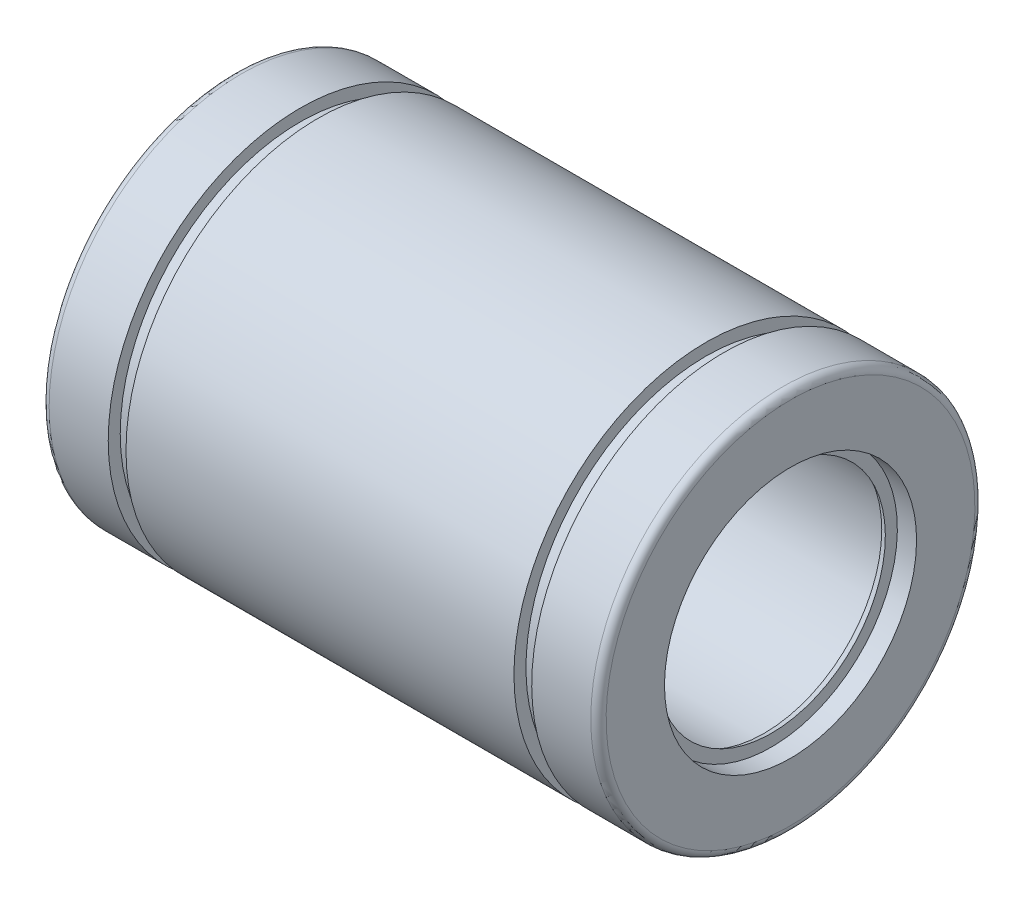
ISO-10303-21;
HEADER;
FILE_DESCRIPTION(('STEP AP214'),'2;1');
FILE_NAME('part.step','',(''),(''),'','','');
FILE_SCHEMA(('AUTOMOTIVE_DESIGN { 1 0 10303 214 1 1 1 1 }'));
ENDSEC;
DATA;
#1=APPLICATION_CONTEXT('core data for automotive mechanical design processes');
#2=APPLICATION_PROTOCOL_DEFINITION('international standard','automotive_design',2000,#1);
#3=PRODUCT_CONTEXT('',#1,'mechanical');
#4=PRODUCT('Part','Part','',(#3));
#5=PRODUCT_RELATED_PRODUCT_CATEGORY('part','',(#4));
#6=PRODUCT_DEFINITION_FORMATION('','',#4);
#7=PRODUCT_DEFINITION_CONTEXT('part definition',#1,'design');
#8=PRODUCT_DEFINITION('design','',#6,#7);
#9=PRODUCT_DEFINITION_SHAPE('','',#8);
#10=(LENGTH_UNIT() NAMED_UNIT(*) SI_UNIT(.MILLI.,.METRE.));
#11=(NAMED_UNIT(*) PLANE_ANGLE_UNIT() SI_UNIT($,.RADIAN.));
#12=(NAMED_UNIT(*) SI_UNIT($,.STERADIAN.) SOLID_ANGLE_UNIT());
#13=UNCERTAINTY_MEASURE_WITH_UNIT(LENGTH_MEASURE(1.E-05),#10,'distance_accuracy_value','');
#14=(GEOMETRIC_REPRESENTATION_CONTEXT(3) GLOBAL_UNCERTAINTY_ASSIGNED_CONTEXT((#13)) GLOBAL_UNIT_ASSIGNED_CONTEXT((#10,
#11,#12)) REPRESENTATION_CONTEXT('',''));
#15=CARTESIAN_POINT('',(0.,0.,0.));
#16=DIRECTION('',(0.,0.,1.));
#17=DIRECTION('',(1.,0.,0.));
#18=AXIS2_PLACEMENT_3D('',#15,#16,#17);
#19=CARTESIAN_POINT('',(0.,0.,-10.));
#20=DIRECTION('',(-1.,0.,0.));
#21=DIRECTION('',(0.,0.,1.));
#22=AXIS2_PLACEMENT_3D('',#19,#20,#21);
#23=PLANE('',#22);
#24=CARTESIAN_POINT('',(0.,0.,0.));
#25=DIRECTION('',(1.,0.,0.));
#26=DIRECTION('',(0.,0.,-1.));
#27=AXIS2_PLACEMENT_3D('',#24,#25,#26);
#28=CIRCLE('',#27,13.125);
#29=CARTESIAN_POINT('',(0.,0.,13.125));
#30=VERTEX_POINT('',#29);
#31=EDGE_CURVE('E233',#30,#30,#28,.T.);
#32=ORIENTED_EDGE('',*,*,#31,.T.);
#33=EDGE_LOOP('',(#32));
#34=FACE_BOUND('',#33,.T.);
#35=CARTESIAN_POINT('',(0.,0.,0.));
#36=DIRECTION('',(-1.,0.,0.));
#37=DIRECTION('',(0.,0.,1.));
#38=AXIS2_PLACEMENT_3D('',#35,#36,#37);
#39=CIRCLE('',#38,19.2);
#40=CARTESIAN_POINT('',(0.,0.,19.2));
#41=VERTEX_POINT('',#40);
#42=CARTESIAN_POINT('',(0.,19.2,0.));
#43=VERTEX_POINT('',#42);
#44=EDGE_CURVE('E350',#41,#43,#39,.T.);
#45=ORIENTED_EDGE('',*,*,#44,.T.);
#46=CARTESIAN_POINT('',(0.,0.,0.));
#47=DIRECTION('',(-1.,0.,0.));
#48=DIRECTION('',(0.,0.,1.));
#49=AXIS2_PLACEMENT_3D('',#46,#47,#48);
#50=CIRCLE('',#49,19.2);
#51=EDGE_CURVE('E354',#43,#41,#50,.T.);
#52=ORIENTED_EDGE('',*,*,#51,.T.);
#53=EDGE_LOOP('',(#45,#52));
#54=FACE_BOUND('',#53,.T.);
#55=ADVANCED_FACE('F16',(#34,#54),#23,.T.);
#56=CARTESIAN_POINT('',(8.8,0.,-19.375));
#57=DIRECTION('',(1.,0.,0.));
#58=DIRECTION('',(0.,1.,0.));
#59=AXIS2_PLACEMENT_3D('',#56,#57,#58);
#60=PLANE('',#59);
#61=CARTESIAN_POINT('',(8.8,0.,0.));
#62=DIRECTION('',(1.,0.,0.));
#63=DIRECTION('',(0.,0.,-1.));
#64=AXIS2_PLACEMENT_3D('',#61,#62,#63);
#65=CIRCLE('',#64,18.75);
#66=CARTESIAN_POINT('',(8.8,0.,18.75));
#67=VERTEX_POINT('',#66);
#68=EDGE_CURVE('E222',#67,#67,#65,.T.);
#69=ORIENTED_EDGE('',*,*,#68,.T.);
#70=EDGE_LOOP('',(#69));
#71=FACE_BOUND('',#70,.T.);
#72=CARTESIAN_POINT('',(8.8,0.,0.));
#73=DIRECTION('',(1.,0.,0.));
#74=DIRECTION('',(0.,0.,-1.));
#75=AXIS2_PLACEMENT_3D('',#72,#73,#74);
#76=CIRCLE('',#75,20.);
#77=CARTESIAN_POINT('',(8.8,0.,20.));
#78=VERTEX_POINT('',#77);
#79=EDGE_CURVE('E204',#78,#78,#76,.T.);
#80=ORIENTED_EDGE('',*,*,#79,.F.);
#81=EDGE_LOOP('',(#80));
#82=FACE_BOUND('',#81,.T.);
#83=ADVANCED_FACE('F401',(#71,#82),#60,.F.);
#84=CARTESIAN_POINT('',(6.95,0.,-19.375));
#85=DIRECTION('',(-1.,0.,0.));
#86=DIRECTION('',(0.,0.,1.));
#87=AXIS2_PLACEMENT_3D('',#84,#85,#86);
#88=PLANE('',#87);
#89=CARTESIAN_POINT('',(6.95,0.,0.));
#90=DIRECTION('',(1.,0.,0.));
#91=DIRECTION('',(0.,0.,-1.));
#92=AXIS2_PLACEMENT_3D('',#89,#90,#91);
#93=CIRCLE('',#92,18.75);
#94=CARTESIAN_POINT('',(6.95,0.,18.75));
#95=VERTEX_POINT('',#94);
#96=EDGE_CURVE('E198',#95,#95,#93,.T.);
#97=ORIENTED_EDGE('',*,*,#96,.F.);
#98=EDGE_LOOP('',(#97));
#99=FACE_BOUND('',#98,.T.);
#100=CARTESIAN_POINT('',(6.95,0.,0.));
#101=DIRECTION('',(-1.,0.,0.));
#102=DIRECTION('',(0.,0.,-1.));
#103=AXIS2_PLACEMENT_3D('',#100,#101,#102);
#104=CIRCLE('',#103,20.);
#105=CARTESIAN_POINT('',(6.95,0.,20.));
#106=VERTEX_POINT('',#105);
#107=EDGE_CURVE('E432',#106,#106,#104,.T.);
#108=ORIENTED_EDGE('',*,*,#107,.F.);
#109=EDGE_LOOP('',(#108));
#110=FACE_BOUND('',#109,.T.);
#111=ADVANCED_FACE('F406',(#99,#110),#88,.F.);
#112=CARTESIAN_POINT('',(2.,0.,-13.75));
#113=DIRECTION('',(-1.,0.,0.));
#114=DIRECTION('',(0.,0.,1.));
#115=AXIS2_PLACEMENT_3D('',#112,#113,#114);
#116=PLANE('',#115);
#117=CARTESIAN_POINT('',(2.,0.,0.));
#118=DIRECTION('',(1.,0.,0.));
#119=DIRECTION('',(0.,0.,-1.));
#120=AXIS2_PLACEMENT_3D('',#117,#118,#119);
#121=CIRCLE('',#120,13.125);
#122=CARTESIAN_POINT('',(2.,0.,13.125));
#123=VERTEX_POINT('',#122);
#124=EDGE_CURVE('E225',#123,#123,#121,.T.);
#125=ORIENTED_EDGE('',*,*,#124,.F.);
#126=EDGE_LOOP('',(#125));
#127=FACE_BOUND('',#126,.T.);
#128=CARTESIAN_POINT('',(2.,0.,0.));
#129=DIRECTION('',(1.,0.,0.));
#130=DIRECTION('',(0.,0.,-1.));
#131=AXIS2_PLACEMENT_3D('',#128,#129,#130);
#132=CIRCLE('',#131,15.);
#133=CARTESIAN_POINT('',(2.,0.,15.));
#134=VERTEX_POINT('',#133);
#135=EDGE_CURVE('E250',#134,#134,#132,.T.);
#136=ORIENTED_EDGE('',*,*,#135,.T.);
#137=EDGE_LOOP('',(#136));
#138=FACE_BOUND('',#137,.T.);
#139=ADVANCED_FACE('F456',(#127,#138),#116,.F.);
#140=CARTESIAN_POINT('',(2.75,0.,-13.75));
#141=DIRECTION('',(1.,0.,0.));
#142=DIRECTION('',(0.,0.,-1.));
#143=AXIS2_PLACEMENT_3D('',#140,#141,#142);
#144=PLANE('',#143);
#145=CARTESIAN_POINT('',(2.75,0.,0.));
#146=DIRECTION('',(-1.,0.,0.));
#147=DIRECTION('',(0.,0.,-1.));
#148=AXIS2_PLACEMENT_3D('',#145,#146,#147);
#149=CIRCLE('',#148,12.5);
#150=CARTESIAN_POINT('',(2.75,0.,12.5));
#151=VERTEX_POINT('',#150);
#152=EDGE_CURVE('E365',#151,#151,#149,.T.);
#153=ORIENTED_EDGE('',*,*,#152,.F.);
#154=EDGE_LOOP('',(#153));
#155=FACE_BOUND('',#154,.T.);
#156=CARTESIAN_POINT('',(2.75,0.,0.));
#157=DIRECTION('',(1.,0.,0.));
#158=DIRECTION('',(0.,0.,-1.));
#159=AXIS2_PLACEMENT_3D('',#156,#157,#158);
#160=CIRCLE('',#159,15.);
#161=CARTESIAN_POINT('',(2.75,0.,15.));
#162=VERTEX_POINT('',#161);
#163=EDGE_CURVE('E314',#162,#162,#160,.T.);
#164=ORIENTED_EDGE('',*,*,#163,.F.);
#165=EDGE_LOOP('',(#164));
#166=FACE_BOUND('',#165,.T.);
#167=ADVANCED_FACE('F458',(#155,#166),#144,.F.);
#168=CARTESIAN_POINT('',(58.,5.,8.66025403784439));
#169=DIRECTION('',(1.,0.,0.));
#170=DIRECTION('',(0.,-1.,0.));
#171=AXIS2_PLACEMENT_3D('',#168,#169,#170);
#172=PLANE('',#171);
#173=CARTESIAN_POINT('',(58.,0.,0.));
#174=DIRECTION('',(-1.,0.,0.));
#175=DIRECTION('',(0.,0.5,0.866025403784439));
#176=AXIS2_PLACEMENT_3D('',#173,#174,#175);
#177=CIRCLE('',#176,13.125);
#178=CARTESIAN_POINT('',(58.,-6.5625,-11.3665834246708));
#179=VERTEX_POINT('',#178);
#180=EDGE_CURVE('E300',#179,#179,#177,.T.);
#181=ORIENTED_EDGE('',*,*,#180,.T.);
#182=EDGE_LOOP('',(#181));
#183=FACE_BOUND('',#182,.T.);
#184=CARTESIAN_POINT('',(58.,0.,0.));
#185=DIRECTION('',(1.,0.,0.));
#186=DIRECTION('',(0.,0.,-1.));
#187=AXIS2_PLACEMENT_3D('',#184,#185,#186);
#188=CIRCLE('',#187,19.2);
#189=CARTESIAN_POINT('',(58.,-9.6,-16.6276877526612));
#190=VERTEX_POINT('',#189);
#191=CARTESIAN_POINT('',(58.,16.6276877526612,-9.6));
#192=VERTEX_POINT('',#191);
#193=EDGE_CURVE('E271',#190,#192,#188,.T.);
#194=ORIENTED_EDGE('',*,*,#193,.T.);
#195=CARTESIAN_POINT('',(58.,0.,0.));
#196=DIRECTION('',(1.,0.,0.));
#197=DIRECTION('',(0.,0.,-1.));
#198=AXIS2_PLACEMENT_3D('',#195,#196,#197);
#199=CIRCLE('',#198,19.2);
#200=EDGE_CURVE('E276',#192,#190,#199,.T.);
#201=ORIENTED_EDGE('',*,*,#200,.T.);
#202=EDGE_LOOP('',(#194,#201));
#203=FACE_BOUND('',#202,.T.);
#204=ADVANCED_FACE('F465',(#183,#203),#172,.T.);
#205=CARTESIAN_POINT('',(49.2,9.6875,16.7792421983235));
#206=DIRECTION('',(-1.,0.,0.));
#207=DIRECTION('',(0.,0.,1.));
#208=AXIS2_PLACEMENT_3D('',#205,#206,#207);
#209=PLANE('',#208);
#210=CARTESIAN_POINT('',(49.2,0.,0.));
#211=DIRECTION('',(-1.,0.,0.));
#212=DIRECTION('',(0.,0.5,0.866025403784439));
#213=AXIS2_PLACEMENT_3D('',#210,#211,#212);
#214=CIRCLE('',#213,18.75);
#215=CARTESIAN_POINT('',(49.2,-9.375,-16.2379763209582));
#216=VERTEX_POINT('',#215);
#217=EDGE_CURVE('E289',#216,#216,#214,.T.);
#218=ORIENTED_EDGE('',*,*,#217,.T.);
#219=EDGE_LOOP('',(#218));
#220=FACE_BOUND('',#219,.T.);
#221=CARTESIAN_POINT('',(49.2,0.,0.));
#222=DIRECTION('',(-1.,0.,0.));
#223=DIRECTION('',(0.,0.5,0.866025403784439));
#224=AXIS2_PLACEMENT_3D('',#221,#222,#223);
#225=CIRCLE('',#224,20.);
#226=CARTESIAN_POINT('',(49.2,10.,17.3205080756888));
#227=VERTEX_POINT('',#226);
#228=CARTESIAN_POINT('',(49.2,0.,20.));
#229=VERTEX_POINT('',#228);
#230=EDGE_CURVE('E189',#227,#229,#225,.T.);
#231=ORIENTED_EDGE('',*,*,#230,.F.);
#232=CARTESIAN_POINT('',(49.2,0.,0.));
#233=DIRECTION('',(-1.,0.,0.));
#234=DIRECTION('',(0.,0.5,0.866025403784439));
#235=AXIS2_PLACEMENT_3D('',#232,#233,#234);
#236=CIRCLE('',#235,20.);
#237=EDGE_CURVE('E195',#229,#227,#236,.T.);
#238=ORIENTED_EDGE('',*,*,#237,.F.);
#239=EDGE_LOOP('',(#231,#238));
#240=FACE_BOUND('',#239,.T.);
#241=ADVANCED_FACE('F200',(#220,#240),#209,.F.);
#242=CARTESIAN_POINT('',(51.05,9.6875,16.7792421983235));
#243=DIRECTION('',(1.,0.,0.));
#244=DIRECTION('',(0.,-1.,0.));
#245=AXIS2_PLACEMENT_3D('',#242,#243,#244);
#246=PLANE('',#245);
#247=CARTESIAN_POINT('',(51.05,0.,0.));
#248=DIRECTION('',(-1.,0.,0.));
#249=DIRECTION('',(0.,0.5,0.866025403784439));
#250=AXIS2_PLACEMENT_3D('',#247,#248,#249);
#251=CIRCLE('',#250,18.75);
#252=CARTESIAN_POINT('',(51.05,-9.375,-16.2379763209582));
#253=VERTEX_POINT('',#252);
#254=EDGE_CURVE('E275',#253,#253,#251,.T.);
#255=ORIENTED_EDGE('',*,*,#254,.F.);
#256=EDGE_LOOP('',(#255));
#257=FACE_BOUND('',#256,.T.);
#258=CARTESIAN_POINT('',(51.05,0.,0.));
#259=DIRECTION('',(1.,0.,0.));
#260=DIRECTION('',(0.,0.5,0.866025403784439));
#261=AXIS2_PLACEMENT_3D('',#258,#259,#260);
#262=CIRCLE('',#261,20.);
#263=CARTESIAN_POINT('',(51.05,-10.,-17.3205080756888));
#264=VERTEX_POINT('',#263);
#265=EDGE_CURVE('E265',#264,#264,#262,.T.);
#266=ORIENTED_EDGE('',*,*,#265,.F.);
#267=EDGE_LOOP('',(#266));
#268=FACE_BOUND('',#267,.T.);
#269=ADVANCED_FACE('F474',(#257,#268),#246,.F.);
#270=CARTESIAN_POINT('',(56.,6.875,11.907849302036));
#271=DIRECTION('',(1.,0.,0.));
#272=DIRECTION('',(0.,-1.,0.));
#273=AXIS2_PLACEMENT_3D('',#270,#271,#272);
#274=PLANE('',#273);
#275=CARTESIAN_POINT('',(56.,0.,0.));
#276=DIRECTION('',(-1.,0.,0.));
#277=DIRECTION('',(0.,0.5,0.866025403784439));
#278=AXIS2_PLACEMENT_3D('',#275,#276,#277);
#279=CIRCLE('',#278,13.125);
#280=CARTESIAN_POINT('',(56.,-6.5625,-11.3665834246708));
#281=VERTEX_POINT('',#280);
#282=EDGE_CURVE('E292',#281,#281,#279,.T.);
#283=ORIENTED_EDGE('',*,*,#282,.F.);
#284=EDGE_LOOP('',(#283));
#285=FACE_BOUND('',#284,.T.);
#286=CARTESIAN_POINT('',(56.,0.,0.));
#287=DIRECTION('',(-1.,0.,0.));
#288=DIRECTION('',(0.,0.5,0.866025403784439));
#289=AXIS2_PLACEMENT_3D('',#286,#287,#288);
#290=CIRCLE('',#289,15.);
#291=CARTESIAN_POINT('',(56.,-7.5,-12.9903810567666));
#292=VERTEX_POINT('',#291);
#293=EDGE_CURVE('E311',#292,#292,#290,.T.);
#294=ORIENTED_EDGE('',*,*,#293,.T.);
#295=EDGE_LOOP('',(#294));
#296=FACE_BOUND('',#295,.T.);
#297=ADVANCED_FACE('F380',(#285,#296),#274,.F.);
#298=CARTESIAN_POINT('',(55.25,6.875,11.907849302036));
#299=DIRECTION('',(-1.,0.,0.));
#300=DIRECTION('',(0.,0.,1.));
#301=AXIS2_PLACEMENT_3D('',#298,#299,#300);
#302=PLANE('',#301);
#303=CARTESIAN_POINT('',(55.25,0.,0.));
#304=DIRECTION('',(1.,0.,0.));
#305=DIRECTION('',(0.,0.5,0.866025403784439));
#306=AXIS2_PLACEMENT_3D('',#303,#304,#305);
#307=CIRCLE('',#306,12.5);
#308=CARTESIAN_POINT('',(55.25,6.25,10.8253175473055));
#309=VERTEX_POINT('',#308);
#310=CARTESIAN_POINT('',(55.25,0.,12.5));
#311=VERTEX_POINT('',#310);
#312=EDGE_CURVE('E359',#309,#311,#307,.T.);
#313=ORIENTED_EDGE('',*,*,#312,.F.);
#314=CARTESIAN_POINT('',(55.25,0.,0.));
#315=DIRECTION('',(1.,0.,0.));
#316=DIRECTION('',(0.,0.5,0.866025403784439));
#317=AXIS2_PLACEMENT_3D('',#314,#315,#316);
#318=CIRCLE('',#317,12.5);
#319=EDGE_CURVE('E211',#311,#309,#318,.T.);
#320=ORIENTED_EDGE('',*,*,#319,.F.);
#321=EDGE_LOOP('',(#313,#320));
#322=FACE_BOUND('',#321,.T.);
#323=CARTESIAN_POINT('',(55.25,0.,0.));
#324=DIRECTION('',(-1.,0.,0.));
#325=DIRECTION('',(0.,0.5,0.866025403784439));
#326=AXIS2_PLACEMENT_3D('',#323,#324,#325);
#327=CIRCLE('',#326,15.);
#328=CARTESIAN_POINT('',(55.25,-7.5,-12.9903810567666));
#329=VERTEX_POINT('',#328);
#330=EDGE_CURVE('E320',#329,#329,#327,.T.);
#331=ORIENTED_EDGE('',*,*,#330,.F.);
#332=EDGE_LOOP('',(#331));
#333=FACE_BOUND('',#332,.T.);
#334=ADVANCED_FACE('F376',(#322,#333),#302,.F.);
#335=CARTESIAN_POINT('',(2.749,0.,-7.5075));
#336=DIRECTION('',(1.,0.,0.));
#337=DIRECTION('',(0.,1.,0.));
#338=AXIS2_PLACEMENT_3D('',#335,#336,#337);
#339=PLANE('',#338);
#340=CARTESIAN_POINT('',(2.749,0.,0.));
#341=DIRECTION('',(-1.,0.,0.));
#342=DIRECTION('',(0.,0.,-1.));
#343=AXIS2_PLACEMENT_3D('',#340,#341,#342);
#344=CIRCLE('',#343,12.25);
#345=CARTESIAN_POINT('',(2.749,0.,12.25));
#346=VERTEX_POINT('',#345);
#347=EDGE_CURVE('E332',#346,#346,#344,.T.);
#348=ORIENTED_EDGE('',*,*,#347,.T.);
#349=EDGE_LOOP('',(#348));
#350=FACE_BOUND('',#349,.T.);
#351=CARTESIAN_POINT('',(2.749,0.,0.));
#352=DIRECTION('',(-1.,0.,0.));
#353=DIRECTION('',(0.,0.,-1.));
#354=AXIS2_PLACEMENT_3D('',#351,#352,#353);
#355=CIRCLE('',#354,15.);
#356=CARTESIAN_POINT('',(2.749,0.,15.));
#357=VERTEX_POINT('',#356);
#358=EDGE_CURVE('E258',#357,#357,#355,.T.);
#359=ORIENTED_EDGE('',*,*,#358,.F.);
#360=EDGE_LOOP('',(#359));
#361=FACE_BOUND('',#360,.T.);
#362=ADVANCED_FACE('F379',(#350,#361),#339,.T.);
#363=CARTESIAN_POINT('',(2.001,0.,-7.5075));
#364=DIRECTION('',(-1.,0.,0.));
#365=DIRECTION('',(0.,0.,1.));
#366=AXIS2_PLACEMENT_3D('',#363,#364,#365);
#367=PLANE('',#366);
#368=CARTESIAN_POINT('',(2.001,0.,0.));
#369=DIRECTION('',(1.,0.,0.));
#370=DIRECTION('',(0.,0.,-1.));
#371=AXIS2_PLACEMENT_3D('',#368,#369,#370);
#372=CIRCLE('',#371,11.875);
#373=CARTESIAN_POINT('',(2.001,0.,11.875));
#374=VERTEX_POINT('',#373);
#375=EDGE_CURVE('E253',#374,#374,#372,.T.);
#376=ORIENTED_EDGE('',*,*,#375,.T.);
#377=EDGE_LOOP('',(#376));
#378=FACE_BOUND('',#377,.T.);
#379=CARTESIAN_POINT('',(2.001,0.,0.));
#380=DIRECTION('',(1.,0.,0.));
#381=DIRECTION('',(0.,0.,-1.));
#382=AXIS2_PLACEMENT_3D('',#379,#380,#381);
#383=CIRCLE('',#382,15.);
#384=CARTESIAN_POINT('',(2.001,0.,15.));
#385=VERTEX_POINT('',#384);
#386=EDGE_CURVE('E236',#385,#385,#383,.T.);
#387=ORIENTED_EDGE('',*,*,#386,.F.);
#388=EDGE_LOOP('',(#387));
#389=FACE_BOUND('',#388,.T.);
#390=ADVANCED_FACE('F446',(#378,#389),#367,.T.);
#391=CARTESIAN_POINT('',(55.251,3.75375,6.50168571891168));
#392=DIRECTION('',(-1.,0.,0.));
#393=DIRECTION('',(0.,0.,1.));
#394=AXIS2_PLACEMENT_3D('',#391,#392,#393);
#395=PLANE('',#394);
#396=CARTESIAN_POINT('',(55.251,0.,0.));
#397=DIRECTION('',(1.,0.,0.));
#398=DIRECTION('',(0.,0.5,0.866025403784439));
#399=AXIS2_PLACEMENT_3D('',#396,#397,#398);
#400=CIRCLE('',#399,12.25);
#401=CARTESIAN_POINT('',(55.251,-6.125,-10.6088111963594));
#402=VERTEX_POINT('',#401);
#403=EDGE_CURVE('E10',#402,#402,#400,.T.);
#404=ORIENTED_EDGE('',*,*,#403,.T.);
#405=EDGE_LOOP('',(#404));
#406=FACE_BOUND('',#405,.T.);
#407=CARTESIAN_POINT('',(55.251,0.,0.));
#408=DIRECTION('',(1.,0.,0.));
#409=DIRECTION('',(0.,0.5,0.866025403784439));
#410=AXIS2_PLACEMENT_3D('',#407,#408,#409);
#411=CIRCLE('',#410,15.);
#412=CARTESIAN_POINT('',(55.251,-7.5,-12.9903810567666));
#413=VERTEX_POINT('',#412);
#414=EDGE_CURVE('E319',#413,#413,#411,.T.);
#415=ORIENTED_EDGE('',*,*,#414,.F.);
#416=EDGE_LOOP('',(#415));
#417=FACE_BOUND('',#416,.T.);
#418=ADVANCED_FACE('F449',(#406,#417),#395,.T.);
#419=CARTESIAN_POINT('',(55.999,3.75375,6.50168571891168));
#420=DIRECTION('',(1.,0.,0.));
#421=DIRECTION('',(0.,-1.,0.));
#422=AXIS2_PLACEMENT_3D('',#419,#420,#421);
#423=PLANE('',#422);
#424=CARTESIAN_POINT('',(55.999,0.,0.));
#425=DIRECTION('',(-1.,0.,0.));
#426=DIRECTION('',(0.,0.5,0.866025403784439));
#427=AXIS2_PLACEMENT_3D('',#424,#425,#426);
#428=CIRCLE('',#427,11.875);
#429=CARTESIAN_POINT('',(55.999,-5.9375,-10.2840516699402));
#430=VERTEX_POINT('',#429);
#431=EDGE_CURVE('E19',#430,#430,#428,.T.);
#432=ORIENTED_EDGE('',*,*,#431,.T.);
#433=EDGE_LOOP('',(#432));
#434=FACE_BOUND('',#433,.T.);
#435=CARTESIAN_POINT('',(55.999,0.,0.));
#436=DIRECTION('',(-1.,0.,0.));
#437=DIRECTION('',(0.,0.5,0.866025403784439));
#438=AXIS2_PLACEMENT_3D('',#435,#436,#437);
#439=CIRCLE('',#438,15.);
#440=CARTESIAN_POINT('',(55.999,-7.5,-12.9903810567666));
#441=VERTEX_POINT('',#440);
#442=EDGE_CURVE('E303',#441,#441,#439,.T.);
#443=ORIENTED_EDGE('',*,*,#442,.F.);
#444=EDGE_LOOP('',(#443));
#445=FACE_BOUND('',#444,.T.);
#446=ADVANCED_FACE('F396',(#434,#445),#423,.T.);
#447=CARTESIAN_POINT('',(55.625,0.,0.));
#448=DIRECTION('',(-1.,0.,0.));
#449=DIRECTION('',(0.,0.5,0.866025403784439));
#450=AXIS2_PLACEMENT_3D('',#447,#448,#449);
#451=CONICAL_SURFACE('',#450,12.0625,0.464716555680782);
#452=ORIENTED_EDGE('',*,*,#431,.F.);
#453=DIRECTION('',(-0.893948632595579,-0.224084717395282,-0.388126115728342));
#454=VECTOR('',#453,1.);
#455=CARTESIAN_POINT('',(55.625,-6.03125,-10.4464314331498));
#456=LINE('',#455,#454);
#457=EDGE_CURVE('E25',#430,#402,#456,.T.);
#458=ORIENTED_EDGE('',*,*,#457,.T.);
#459=ORIENTED_EDGE('',*,*,#403,.F.);
#460=ORIENTED_EDGE('',*,*,#457,.F.);
#461=EDGE_LOOP('',(#452,#458,#459,#460));
#462=FACE_BOUND('',#461,.T.);
#463=ADVANCED_FACE('F386',(#462),#451,.F.);
#464=CARTESIAN_POINT('',(55.625,0.,0.));
#465=DIRECTION('',(1.,0.,0.));
#466=DIRECTION('',(0.,0.5,0.866025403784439));
#467=AXIS2_PLACEMENT_3D('',#464,#465,#466);
#468=CYLINDRICAL_SURFACE('',#467,15.);
#469=ORIENTED_EDGE('',*,*,#330,.T.);
#470=DIRECTION('',(1.,0.,0.));
#471=VECTOR('',#470,1.);
#472=CARTESIAN_POINT('',(55.625,-7.5,-12.9903810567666));
#473=LINE('',#472,#471);
#474=EDGE_CURVE('E315',#329,#413,#473,.T.);
#475=ORIENTED_EDGE('',*,*,#474,.T.);
#476=ORIENTED_EDGE('',*,*,#414,.T.);
#477=ORIENTED_EDGE('',*,*,#474,.F.);
#478=EDGE_LOOP('',(#469,#475,#476,#477));
#479=FACE_BOUND('',#478,.T.);
#480=ADVANCED_FACE('F383',(#479),#468,.F.);
#481=CARTESIAN_POINT('',(2.375,0.,0.));
#482=DIRECTION('',(1.,0.,0.));
#483=DIRECTION('',(0.,0.,-1.));
#484=AXIS2_PLACEMENT_3D('',#481,#482,#483);
#485=CONICAL_SURFACE('',#484,12.0625,0.464716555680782);
#486=ORIENTED_EDGE('',*,*,#375,.F.);
#487=DIRECTION('',(0.893948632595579,0.,0.448169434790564));
#488=VECTOR('',#487,1.);
#489=CARTESIAN_POINT('',(2.375,0.,12.0625));
#490=LINE('',#489,#488);
#491=EDGE_CURVE('E257',#374,#346,#490,.T.);
#492=ORIENTED_EDGE('',*,*,#491,.T.);
#493=ORIENTED_EDGE('',*,*,#347,.F.);
#494=ORIENTED_EDGE('',*,*,#491,.F.);
#495=EDGE_LOOP('',(#486,#492,#493,#494));
#496=FACE_BOUND('',#495,.T.);
#497=ADVANCED_FACE('F385',(#496),#485,.F.);
#498=CARTESIAN_POINT('',(2.375,0.,0.));
#499=DIRECTION('',(-1.,0.,0.));
#500=DIRECTION('',(0.,0.,-1.));
#501=AXIS2_PLACEMENT_3D('',#498,#499,#500);
#502=CYLINDRICAL_SURFACE('',#501,15.);
#503=ORIENTED_EDGE('',*,*,#163,.T.);
#504=DIRECTION('',(-1.,0.,0.));
#505=VECTOR('',#504,1.);
#506=CARTESIAN_POINT('',(2.375,0.,15.));
#507=LINE('',#506,#505);
#508=EDGE_CURVE('E324',#162,#357,#507,.T.);
#509=ORIENTED_EDGE('',*,*,#508,.T.);
#510=ORIENTED_EDGE('',*,*,#358,.T.);
#511=ORIENTED_EDGE('',*,*,#508,.F.);
#512=EDGE_LOOP('',(#503,#509,#510,#511));
#513=FACE_BOUND('',#512,.T.);
#514=ADVANCED_FACE('F393',(#513),#502,.F.);
#515=CARTESIAN_POINT('',(55.625,0.,0.));
#516=DIRECTION('',(1.,0.,0.));
#517=DIRECTION('',(0.,0.5,0.866025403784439));
#518=AXIS2_PLACEMENT_3D('',#515,#516,#517);
#519=CYLINDRICAL_SURFACE('',#518,15.);
#520=ORIENTED_EDGE('',*,*,#442,.T.);
#521=DIRECTION('',(1.,0.,0.));
#522=VECTOR('',#521,1.);
#523=CARTESIAN_POINT('',(55.625,-7.5,-12.9903810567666));
#524=LINE('',#523,#522);
#525=EDGE_CURVE('E307',#441,#292,#524,.T.);
#526=ORIENTED_EDGE('',*,*,#525,.T.);
#527=ORIENTED_EDGE('',*,*,#293,.F.);
#528=ORIENTED_EDGE('',*,*,#525,.F.);
#529=EDGE_LOOP('',(#520,#526,#527,#528));
#530=FACE_BOUND('',#529,.T.);
#531=ADVANCED_FACE('F492',(#530),#519,.F.);
#532=CARTESIAN_POINT('',(57.,0.,0.));
#533=DIRECTION('',(1.,0.,0.));
#534=DIRECTION('',(0.,0.5,0.866025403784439));
#535=AXIS2_PLACEMENT_3D('',#532,#533,#534);
#536=CYLINDRICAL_SURFACE('',#535,13.125);
#537=ORIENTED_EDGE('',*,*,#282,.T.);
#538=DIRECTION('',(1.,0.,0.));
#539=VECTOR('',#538,1.);
#540=CARTESIAN_POINT('',(57.,-6.5625,-11.3665834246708));
#541=LINE('',#540,#539);
#542=EDGE_CURVE('E296',#281,#179,#541,.T.);
#543=ORIENTED_EDGE('',*,*,#542,.T.);
#544=ORIENTED_EDGE('',*,*,#180,.F.);
#545=ORIENTED_EDGE('',*,*,#542,.F.);
#546=EDGE_LOOP('',(#537,#543,#544,#545));
#547=FACE_BOUND('',#546,.T.);
#548=ADVANCED_FACE('F496',(#547),#536,.F.);
#549=CARTESIAN_POINT('',(50.5875,0.,0.));
#550=DIRECTION('',(1.,0.,0.));
#551=DIRECTION('',(0.,0.5,0.866025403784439));
#552=AXIS2_PLACEMENT_3D('',#549,#550,#551);
#553=CYLINDRICAL_SURFACE('',#552,18.75);
#554=ORIENTED_EDGE('',*,*,#254,.T.);
#555=DIRECTION('',(-1.,0.,0.));
#556=VECTOR('',#555,1.);
#557=CARTESIAN_POINT('',(50.5875,-9.375,-16.2379763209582));
#558=LINE('',#557,#556);
#559=EDGE_CURVE('E285',#253,#216,#558,.T.);
#560=ORIENTED_EDGE('',*,*,#559,.T.);
#561=ORIENTED_EDGE('',*,*,#217,.F.);
#562=ORIENTED_EDGE('',*,*,#559,.F.);
#563=EDGE_LOOP('',(#554,#560,#561,#562));
#564=FACE_BOUND('',#563,.T.);
#565=ADVANCED_FACE('F502',(#564),#553,.T.);
#566=CARTESIAN_POINT('',(57.2,0.,0.));
#567=DIRECTION('',(1.,0.,0.));
#568=DIRECTION('',(0.,-0.866025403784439,0.5));
#569=AXIS2_PLACEMENT_3D('',#566,#567,#568);
#570=TOROIDAL_SURFACE('',#569,19.2,0.8);
#571=ORIENTED_EDGE('',*,*,#193,.F.);
#572=ORIENTED_EDGE('',*,*,#200,.F.);
#573=CARTESIAN_POINT('',(57.2,16.6276877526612,-9.6));
#574=DIRECTION('',(0.,0.5,0.866025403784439));
#575=DIRECTION('',(0.,0.866025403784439,-0.5));
#576=AXIS2_PLACEMENT_3D('',#573,#574,#575);
#577=CIRCLE('',#576,0.8);
#578=CARTESIAN_POINT('',(57.2,17.3205080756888,-10.));
#579=VERTEX_POINT('',#578);
#580=EDGE_CURVE('E272',#192,#579,#577,.T.);
#581=ORIENTED_EDGE('',*,*,#580,.T.);
#582=CARTESIAN_POINT('',(57.2,0.,0.));
#583=DIRECTION('',(-1.,0.,0.));
#584=DIRECTION('',(0.,0.5,0.866025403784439));
#585=AXIS2_PLACEMENT_3D('',#582,#583,#584);
#586=CIRCLE('',#585,20.);
#587=CARTESIAN_POINT('',(57.2,-17.3205080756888,10.));
#588=VERTEX_POINT('',#587);
#589=EDGE_CURVE('E246',#588,#579,#586,.T.);
#590=ORIENTED_EDGE('',*,*,#589,.F.);
#591=CARTESIAN_POINT('',(57.2,0.,0.));
#592=DIRECTION('',(-1.,0.,0.));
#593=DIRECTION('',(0.,0.5,0.866025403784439));
#594=AXIS2_PLACEMENT_3D('',#591,#592,#593);
#595=CIRCLE('',#594,20.);
#596=CARTESIAN_POINT('',(57.2,-10.,-17.3205080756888));
#597=VERTEX_POINT('',#596);
#598=EDGE_CURVE('E268',#597,#588,#595,.T.);
#599=ORIENTED_EDGE('',*,*,#598,.F.);
#600=CARTESIAN_POINT('',(57.2,0.,0.));
#601=DIRECTION('',(-1.,0.,0.));
#602=DIRECTION('',(0.,0.5,0.866025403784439));
#603=AXIS2_PLACEMENT_3D('',#600,#601,#602);
#604=CIRCLE('',#603,20.);
#605=EDGE_CURVE('E241',#579,#597,#604,.T.);
#606=ORIENTED_EDGE('',*,*,#605,.F.);
#607=ORIENTED_EDGE('',*,*,#580,.F.);
#608=EDGE_LOOP('',(#571,#572,#581,#590,#599,#606,#607));
#609=FACE_BOUND('',#608,.T.);
#610=ADVANCED_FACE('F518',(#609),#570,.T.);
#611=CARTESIAN_POINT('',(51.75,0.,0.));
#612=DIRECTION('',(1.,0.,0.));
#613=DIRECTION('',(0.,0.5,0.866025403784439));
#614=AXIS2_PLACEMENT_3D('',#611,#612,#613);
#615=CYLINDRICAL_SURFACE('',#614,20.);
#616=ORIENTED_EDGE('',*,*,#589,.T.);
#617=ORIENTED_EDGE('',*,*,#605,.T.);
#618=DIRECTION('',(-1.,0.,0.));
#619=VECTOR('',#618,1.);
#620=CARTESIAN_POINT('',(51.75,-10.,-17.3205080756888));
#621=LINE('',#620,#619);
#622=EDGE_CURVE('E245',#597,#264,#621,.T.);
#623=ORIENTED_EDGE('',*,*,#622,.T.);
#624=ORIENTED_EDGE('',*,*,#265,.T.);
#625=ORIENTED_EDGE('',*,*,#622,.F.);
#626=ORIENTED_EDGE('',*,*,#598,.T.);
#627=EDGE_LOOP('',(#616,#617,#623,#624,#625,#626));
#628=FACE_BOUND('',#627,.T.);
#629=ADVANCED_FACE('F523',(#628),#615,.T.);
#630=CARTESIAN_POINT('',(2.375,0.,0.));
#631=DIRECTION('',(-1.,0.,0.));
#632=DIRECTION('',(0.,0.,-1.));
#633=AXIS2_PLACEMENT_3D('',#630,#631,#632);
#634=CYLINDRICAL_SURFACE('',#633,15.);
#635=ORIENTED_EDGE('',*,*,#386,.T.);
#636=DIRECTION('',(-1.,0.,0.));
#637=VECTOR('',#636,1.);
#638=CARTESIAN_POINT('',(2.375,0.,15.));
#639=LINE('',#638,#637);
#640=EDGE_CURVE('E240',#385,#134,#639,.T.);
#641=ORIENTED_EDGE('',*,*,#640,.T.);
#642=ORIENTED_EDGE('',*,*,#135,.F.);
#643=ORIENTED_EDGE('',*,*,#640,.F.);
#644=EDGE_LOOP('',(#635,#641,#642,#643));
#645=FACE_BOUND('',#644,.T.);
#646=ADVANCED_FACE('F453',(#645),#634,.F.);
#647=CARTESIAN_POINT('',(1.,0.,0.));
#648=DIRECTION('',(-1.,0.,0.));
#649=DIRECTION('',(0.,0.,-1.));
#650=AXIS2_PLACEMENT_3D('',#647,#648,#649);
#651=CYLINDRICAL_SURFACE('',#650,13.125);
#652=ORIENTED_EDGE('',*,*,#124,.T.);
#653=DIRECTION('',(-1.,0.,0.));
#654=VECTOR('',#653,1.);
#655=CARTESIAN_POINT('',(1.,0.,13.125));
#656=LINE('',#655,#654);
#657=EDGE_CURVE('E229',#123,#30,#656,.T.);
#658=ORIENTED_EDGE('',*,*,#657,.T.);
#659=ORIENTED_EDGE('',*,*,#31,.F.);
#660=ORIENTED_EDGE('',*,*,#657,.F.);
#661=EDGE_LOOP('',(#652,#658,#659,#660));
#662=FACE_BOUND('',#661,.T.);
#663=ADVANCED_FACE('F532',(#662),#651,.F.);
#664=CARTESIAN_POINT('',(7.4125,0.,0.));
#665=DIRECTION('',(-1.,0.,0.));
#666=DIRECTION('',(0.,0.,-1.));
#667=AXIS2_PLACEMENT_3D('',#664,#665,#666);
#668=CYLINDRICAL_SURFACE('',#667,18.75);
#669=ORIENTED_EDGE('',*,*,#96,.T.);
#670=DIRECTION('',(1.,0.,0.));
#671=VECTOR('',#670,1.);
#672=CARTESIAN_POINT('',(7.4125,0.,18.75));
#673=LINE('',#672,#671);
#674=EDGE_CURVE('E218',#95,#67,#673,.T.);
#675=ORIENTED_EDGE('',*,*,#674,.T.);
#676=ORIENTED_EDGE('',*,*,#68,.F.);
#677=ORIENTED_EDGE('',*,*,#674,.F.);
#678=EDGE_LOOP('',(#669,#675,#676,#677));
#679=FACE_BOUND('',#678,.T.);
#680=ADVANCED_FACE('F540',(#679),#668,.T.);
#681=CARTESIAN_POINT('',(6.25,0.,0.));
#682=DIRECTION('',(-1.,0.,0.));
#683=DIRECTION('',(0.,0.,-1.));
#684=AXIS2_PLACEMENT_3D('',#681,#682,#683);
#685=CYLINDRICAL_SURFACE('',#684,20.);
#686=ORIENTED_EDGE('',*,*,#79,.T.);
#687=DIRECTION('',(1.,0.,0.));
#688=VECTOR('',#687,1.);
#689=CARTESIAN_POINT('',(6.25,0.,20.));
#690=LINE('',#689,#688);
#691=EDGE_CURVE('E194',#78,#229,#690,.T.);
#692=ORIENTED_EDGE('',*,*,#691,.T.);
#693=ORIENTED_EDGE('',*,*,#237,.T.);
#694=ORIENTED_EDGE('',*,*,#230,.T.);
#695=ORIENTED_EDGE('',*,*,#691,.F.);
#696=EDGE_LOOP('',(#686,#692,#693,#694,#695));
#697=FACE_BOUND('',#696,.T.);
#698=ADVANCED_FACE('F192',(#697),#685,.T.);
#699=CARTESIAN_POINT('',(6.25,0.,0.));
#700=DIRECTION('',(-1.,0.,0.));
#701=DIRECTION('',(0.,0.,-1.));
#702=AXIS2_PLACEMENT_3D('',#699,#700,#701);
#703=CYLINDRICAL_SURFACE('',#702,12.5);
#704=ORIENTED_EDGE('',*,*,#312,.T.);
#705=DIRECTION('',(-1.,0.,0.));
#706=VECTOR('',#705,1.);
#707=CARTESIAN_POINT('',(6.25,0.,12.5));
#708=LINE('',#707,#706);
#709=EDGE_CURVE('E348',#311,#151,#708,.T.);
#710=ORIENTED_EDGE('',*,*,#709,.T.);
#711=ORIENTED_EDGE('',*,*,#152,.T.);
#712=ORIENTED_EDGE('',*,*,#709,.F.);
#713=ORIENTED_EDGE('',*,*,#319,.T.);
#714=EDGE_LOOP('',(#704,#710,#711,#712,#713));
#715=FACE_BOUND('',#714,.T.);
#716=ADVANCED_FACE('F373',(#715),#703,.F.);
#717=CARTESIAN_POINT('',(0.8,0.,0.));
#718=DIRECTION('',(-1.,0.,0.));
#719=DIRECTION('',(0.,-1.,0.));
#720=AXIS2_PLACEMENT_3D('',#717,#718,#719);
#721=TOROIDAL_SURFACE('',#720,19.2,0.8);
#722=ORIENTED_EDGE('',*,*,#44,.F.);
#723=ORIENTED_EDGE('',*,*,#51,.F.);
#724=CARTESIAN_POINT('',(0.8,19.2,0.));
#725=DIRECTION('',(0.,0.,-1.));
#726=DIRECTION('',(0.,1.,0.));
#727=AXIS2_PLACEMENT_3D('',#724,#725,#726);
#728=CIRCLE('',#727,0.8);
#729=CARTESIAN_POINT('',(0.8,20.,0.));
#730=VERTEX_POINT('',#729);
#731=EDGE_CURVE('E356',#43,#730,#728,.T.);
#732=ORIENTED_EDGE('',*,*,#731,.T.);
#733=CARTESIAN_POINT('',(0.8,0.,0.));
#734=DIRECTION('',(1.,0.,0.));
#735=DIRECTION('',(0.,0.,-1.));
#736=AXIS2_PLACEMENT_3D('',#733,#734,#735);
#737=CIRCLE('',#736,20.);
#738=CARTESIAN_POINT('',(0.8,-20.,0.));
#739=VERTEX_POINT('',#738);
#740=EDGE_CURVE('E419',#739,#730,#737,.T.);
#741=ORIENTED_EDGE('',*,*,#740,.F.);
#742=CARTESIAN_POINT('',(0.8,0.,0.));
#743=DIRECTION('',(1.,0.,0.));
#744=DIRECTION('',(0.,0.,-1.));
#745=AXIS2_PLACEMENT_3D('',#742,#743,#744);
#746=CIRCLE('',#745,20.);
#747=CARTESIAN_POINT('',(0.8,0.,20.));
#748=VERTEX_POINT('',#747);
#749=EDGE_CURVE('E355',#748,#739,#746,.T.);
#750=ORIENTED_EDGE('',*,*,#749,.F.);
#751=CARTESIAN_POINT('',(0.8,0.,0.));
#752=DIRECTION('',(1.,0.,0.));
#753=DIRECTION('',(0.,0.,-1.));
#754=AXIS2_PLACEMENT_3D('',#751,#752,#753);
#755=CIRCLE('',#754,20.);
#756=EDGE_CURVE('E416',#730,#748,#755,.T.);
#757=ORIENTED_EDGE('',*,*,#756,.F.);
#758=ORIENTED_EDGE('',*,*,#731,.F.);
#759=EDGE_LOOP('',(#722,#723,#732,#741,#750,#757,#758));
#760=FACE_BOUND('',#759,.T.);
#761=ADVANCED_FACE('F413',(#760),#721,.T.);
#762=CARTESIAN_POINT('',(6.25,0.,0.));
#763=DIRECTION('',(-1.,0.,0.));
#764=DIRECTION('',(0.,0.,-1.));
#765=AXIS2_PLACEMENT_3D('',#762,#763,#764);
#766=CYLINDRICAL_SURFACE('',#765,20.);
#767=ORIENTED_EDGE('',*,*,#740,.T.);
#768=ORIENTED_EDGE('',*,*,#756,.T.);
#769=DIRECTION('',(1.,0.,0.));
#770=VECTOR('',#769,1.);
#771=CARTESIAN_POINT('',(6.25,0.,20.));
#772=LINE('',#771,#770);
#773=EDGE_CURVE('E427',#748,#106,#772,.T.);
#774=ORIENTED_EDGE('',*,*,#773,.T.);
#775=ORIENTED_EDGE('',*,*,#107,.T.);
#776=ORIENTED_EDGE('',*,*,#773,.F.);
#777=ORIENTED_EDGE('',*,*,#749,.T.);
#778=EDGE_LOOP('',(#767,#768,#774,#775,#776,#777));
#779=FACE_BOUND('',#778,.T.);
#780=ADVANCED_FACE('F535',(#779),#766,.T.);
#781=CLOSED_SHELL('',(#55,#83,#111,#139,#167,#204,#241,#269,#297,#334,#362,#390,#418,#446,#463,
#480,#497,#514,#531,#548,#565,#610,#629,#646,#663,#680,#698,#716,#761,#780));
#782=MANIFOLD_SOLID_BREP('B1',#781);
#783=ADVANCED_BREP_SHAPE_REPRESENTATION('',(#18,#782),#14);
#784=SHAPE_DEFINITION_REPRESENTATION(#9,#783);
ENDSEC;
END-ISO-10303-21;
